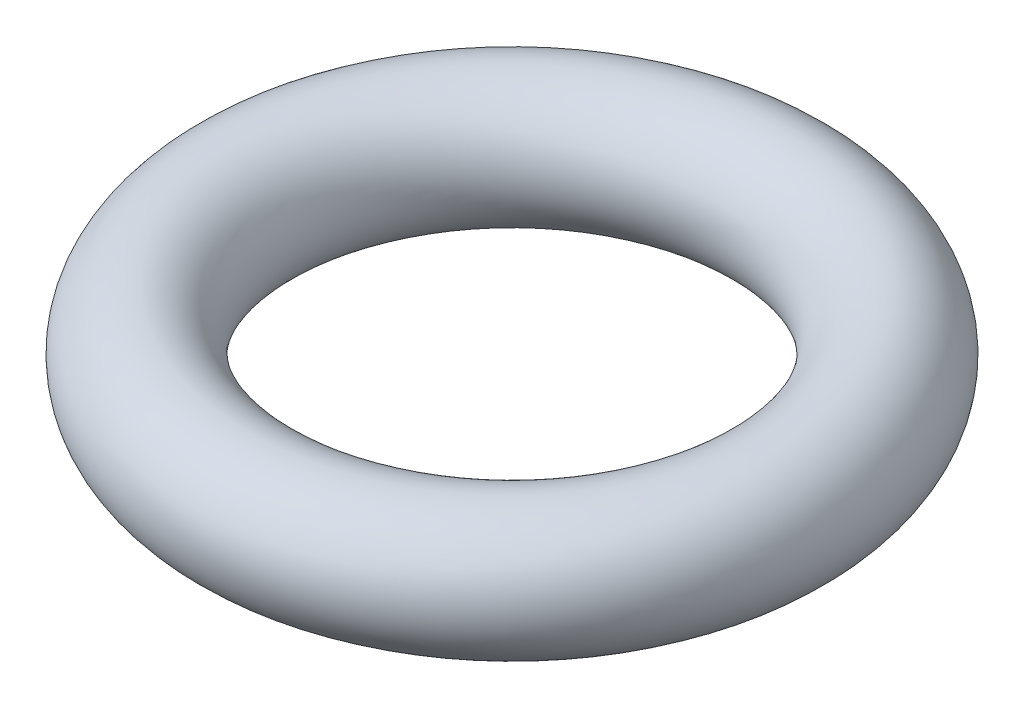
from build123d import *

# Parameters (mm, degrees)
ESQUISSE1_R = 0.85


with BuildPart() as part:
    # Esquisse1 → R_volution1 (revolve)
    with BuildSketch(Plane.XY, mode=Mode.PRIVATE) as r_volution1_sk:
        with Locations((3.525, 0)):
            Circle(ESQUISSE1_R)
    revolve(r_volution1_sk.sketch.rotate(Axis((0, 0, 0), (0, 1, 0)), 90), axis=Axis((0, 0, 0), (0, 1, 0)))


solid = part.part
